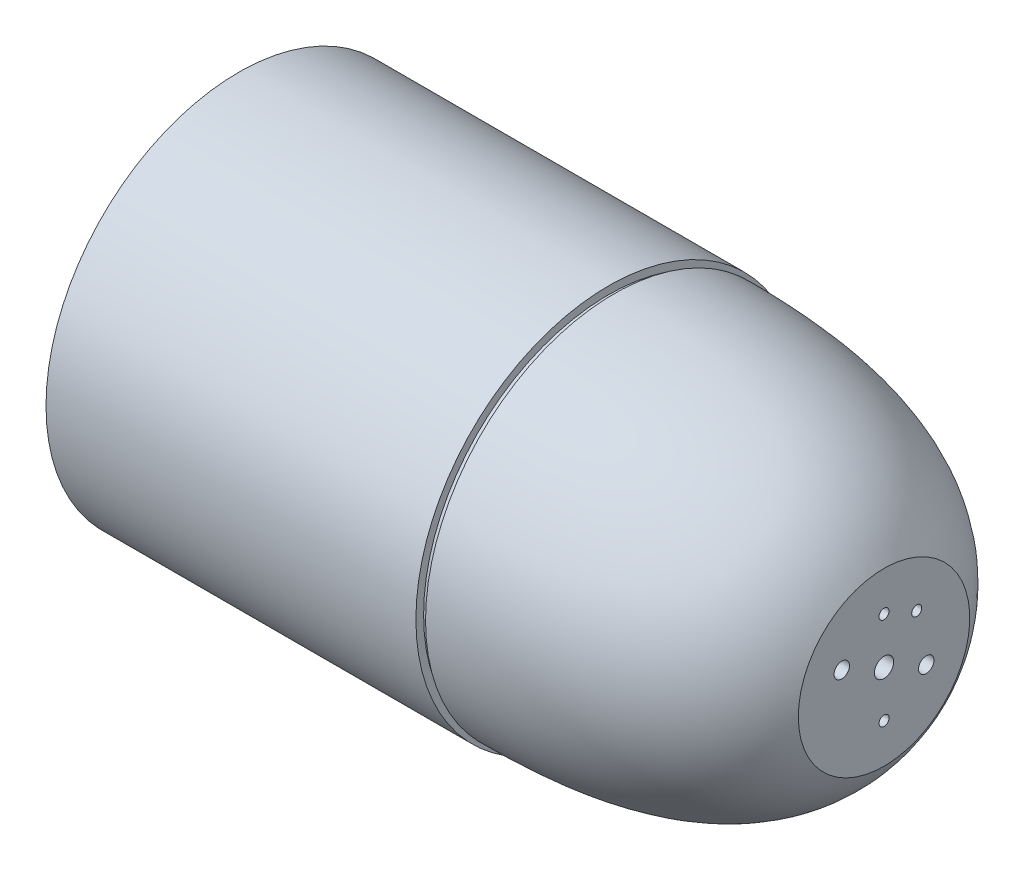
ISO-10303-21;
HEADER;
FILE_DESCRIPTION(('STEP AP214'),'2;1');
FILE_NAME('part.step','',(''),(''),'','','');
FILE_SCHEMA(('AUTOMOTIVE_DESIGN { 1 0 10303 214 1 1 1 1 }'));
ENDSEC;
DATA;
#1=APPLICATION_CONTEXT('core data for automotive mechanical design processes');
#2=APPLICATION_PROTOCOL_DEFINITION('international standard','automotive_design',2000,#1);
#3=PRODUCT_CONTEXT('',#1,'mechanical');
#4=PRODUCT('Part','Part','',(#3));
#5=PRODUCT_RELATED_PRODUCT_CATEGORY('part','',(#4));
#6=PRODUCT_DEFINITION_FORMATION('','',#4);
#7=PRODUCT_DEFINITION_CONTEXT('part definition',#1,'design');
#8=PRODUCT_DEFINITION('design','',#6,#7);
#9=PRODUCT_DEFINITION_SHAPE('','',#8);
#10=(LENGTH_UNIT() NAMED_UNIT(*) SI_UNIT(.MILLI.,.METRE.));
#11=(NAMED_UNIT(*) PLANE_ANGLE_UNIT() SI_UNIT($,.RADIAN.));
#12=(NAMED_UNIT(*) SI_UNIT($,.STERADIAN.) SOLID_ANGLE_UNIT());
#13=UNCERTAINTY_MEASURE_WITH_UNIT(LENGTH_MEASURE(1.E-05),#10,'distance_accuracy_value','');
#14=(GEOMETRIC_REPRESENTATION_CONTEXT(3) GLOBAL_UNCERTAINTY_ASSIGNED_CONTEXT((#13)) GLOBAL_UNIT_ASSIGNED_CONTEXT((#10,
#11,#12)) REPRESENTATION_CONTEXT('',''));
#15=CARTESIAN_POINT('',(0.,0.,0.));
#16=DIRECTION('',(0.,0.,1.));
#17=DIRECTION('',(1.,0.,0.));
#18=AXIS2_PLACEMENT_3D('',#15,#16,#17);
#19=CARTESIAN_POINT('',(192.,96.,0.));
#20=DIRECTION('',(-1.,0.,0.));
#21=DIRECTION('',(0.,0.,1.));
#22=AXIS2_PLACEMENT_3D('',#19,#20,#21);
#23=PLANE('',#22);
#24=CARTESIAN_POINT('',(192.,0.,0.));
#25=DIRECTION('',(-1.,0.,0.));
#26=DIRECTION('',(0.,0.,1.));
#27=AXIS2_PLACEMENT_3D('',#24,#25,#26);
#28=CIRCLE('',#27,100.);
#29=CARTESIAN_POINT('',(192.,0.,100.));
#30=VERTEX_POINT('',#29);
#31=EDGE_CURVE('E10',#30,#30,#28,.T.);
#32=ORIENTED_EDGE('',*,*,#31,.F.);
#33=EDGE_LOOP('',(#32));
#34=FACE_BOUND('',#33,.T.);
#35=CARTESIAN_POINT('',(192.,0.,0.));
#36=DIRECTION('',(-1.,0.,0.));
#37=DIRECTION('',(0.,0.,1.));
#38=AXIS2_PLACEMENT_3D('',#35,#36,#37);
#39=CIRCLE('',#38,96.);
#40=CARTESIAN_POINT('',(192.,0.,96.));
#41=VERTEX_POINT('',#40);
#42=EDGE_CURVE('E128',#41,#41,#39,.T.);
#43=ORIENTED_EDGE('',*,*,#42,.T.);
#44=EDGE_LOOP('',(#43));
#45=FACE_BOUND('',#44,.T.);
#46=ADVANCED_FACE('F30',(#34,#45),#23,.F.);
#47=CARTESIAN_POINT('',(-4.54259618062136,0.,0.));
#48=DIRECTION('',(-1.,0.,0.));
#49=DIRECTION('',(0.,0.,1.));
#50=AXIS2_PLACEMENT_3D('',#47,#48,#49);
#51=CYLINDRICAL_SURFACE('',#50,100.);
#52=CARTESIAN_POINT('',(0.,0.,0.));
#53=DIRECTION('',(-1.,0.,0.));
#54=DIRECTION('',(0.,0.,1.));
#55=AXIS2_PLACEMENT_3D('',#52,#53,#54);
#56=CIRCLE('',#55,100.);
#57=CARTESIAN_POINT('',(0.,0.,100.));
#58=VERTEX_POINT('',#57);
#59=EDGE_CURVE('E37',#58,#58,#56,.T.);
#60=ORIENTED_EDGE('',*,*,#59,.F.);
#61=EDGE_LOOP('',(#60));
#62=FACE_BOUND('',#61,.T.);
#63=ORIENTED_EDGE('',*,*,#31,.T.);
#64=EDGE_LOOP('',(#63));
#65=FACE_BOUND('',#64,.T.);
#66=ADVANCED_FACE('F200',(#62,#65),#51,.T.);
#67=CARTESIAN_POINT('',(0.,96.5,0.));
#68=DIRECTION('',(1.,0.,0.));
#69=DIRECTION('',(0.,0.,-1.));
#70=AXIS2_PLACEMENT_3D('',#67,#68,#69);
#71=PLANE('',#70);
#72=CARTESIAN_POINT('',(0.,0.,0.));
#73=DIRECTION('',(-1.,0.,0.));
#74=DIRECTION('',(0.,0.,1.));
#75=AXIS2_PLACEMENT_3D('',#72,#73,#74);
#76=CIRCLE('',#75,96.5);
#77=CARTESIAN_POINT('',(0.,0.,96.5));
#78=VERTEX_POINT('',#77);
#79=EDGE_CURVE('E42',#78,#78,#76,.T.);
#80=ORIENTED_EDGE('',*,*,#79,.F.);
#81=EDGE_LOOP('',(#80));
#82=FACE_BOUND('',#81,.T.);
#83=ORIENTED_EDGE('',*,*,#59,.T.);
#84=EDGE_LOOP('',(#83));
#85=FACE_BOUND('',#84,.T.);
#86=ADVANCED_FACE('F197',(#82,#85),#71,.F.);
#87=CARTESIAN_POINT('',(-4.54259618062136,0.,0.));
#88=DIRECTION('',(-1.,0.,0.));
#89=DIRECTION('',(0.,0.,1.));
#90=AXIS2_PLACEMENT_3D('',#87,#88,#89);
#91=CYLINDRICAL_SURFACE('',#90,96.5);
#92=CARTESIAN_POINT('',(1.99999999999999,0.,0.));
#93=DIRECTION('',(-1.,0.,0.));
#94=DIRECTION('',(0.,0.,1.));
#95=AXIS2_PLACEMENT_3D('',#92,#93,#94);
#96=CIRCLE('',#95,96.5);
#97=CARTESIAN_POINT('',(1.99999999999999,0.,96.5));
#98=VERTEX_POINT('',#97);
#99=EDGE_CURVE('E262',#98,#98,#96,.T.);
#100=ORIENTED_EDGE('',*,*,#99,.F.);
#101=EDGE_LOOP('',(#100));
#102=FACE_BOUND('',#101,.T.);
#103=ORIENTED_EDGE('',*,*,#79,.T.);
#104=EDGE_LOOP('',(#103));
#105=FACE_BOUND('',#104,.T.);
#106=ADVANCED_FACE('F193',(#102,#105),#91,.F.);
#107=CARTESIAN_POINT('',(2.,0.,0.));
#108=DIRECTION('',(-1.,0.,0.));
#109=DIRECTION('',(0.,0.,1.));
#110=AXIS2_PLACEMENT_3D('',#107,#108,#109);
#111=TOROIDAL_SURFACE('',#110,95.5,1.);
#112=CARTESIAN_POINT('',(3.,0.,0.));
#113=DIRECTION('',(-1.,0.,0.));
#114=DIRECTION('',(0.,0.,1.));
#115=AXIS2_PLACEMENT_3D('',#112,#113,#114);
#116=CIRCLE('',#115,95.5);
#117=CARTESIAN_POINT('',(3.,0.,95.5));
#118=VERTEX_POINT('',#117);
#119=EDGE_CURVE('E259',#118,#118,#116,.T.);
#120=ORIENTED_EDGE('',*,*,#119,.F.);
#121=EDGE_LOOP('',(#120));
#122=FACE_BOUND('',#121,.T.);
#123=ORIENTED_EDGE('',*,*,#99,.T.);
#124=EDGE_LOOP('',(#123));
#125=FACE_BOUND('',#124,.T.);
#126=ADVANCED_FACE('F189',(#122,#125),#111,.F.);
#127=CARTESIAN_POINT('',(3.,95.,0.));
#128=DIRECTION('',(1.,0.,0.));
#129=DIRECTION('',(0.,0.,-1.));
#130=AXIS2_PLACEMENT_3D('',#127,#128,#129);
#131=PLANE('',#130);
#132=CARTESIAN_POINT('',(3.,0.,0.));
#133=DIRECTION('',(-1.,0.,0.));
#134=DIRECTION('',(0.,0.,1.));
#135=AXIS2_PLACEMENT_3D('',#132,#133,#134);
#136=CIRCLE('',#135,95.);
#137=CARTESIAN_POINT('',(3.,0.,95.));
#138=VERTEX_POINT('',#137);
#139=EDGE_CURVE('E256',#138,#138,#136,.T.);
#140=ORIENTED_EDGE('',*,*,#139,.F.);
#141=EDGE_LOOP('',(#140));
#142=FACE_BOUND('',#141,.T.);
#143=ORIENTED_EDGE('',*,*,#119,.T.);
#144=EDGE_LOOP('',(#143));
#145=FACE_BOUND('',#144,.T.);
#146=ADVANCED_FACE('F185',(#142,#145),#131,.F.);
#147=CARTESIAN_POINT('',(-4.54259618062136,0.,0.));
#148=DIRECTION('',(-1.,0.,0.));
#149=DIRECTION('',(0.,0.,1.));
#150=AXIS2_PLACEMENT_3D('',#147,#148,#149);
#151=CYLINDRICAL_SURFACE('',#150,95.);
#152=CARTESIAN_POINT('',(30.5999999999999,0.,0.));
#153=DIRECTION('',(-1.,0.,0.));
#154=DIRECTION('',(0.,0.,1.));
#155=AXIS2_PLACEMENT_3D('',#152,#153,#154);
#156=CIRCLE('',#155,95.);
#157=CARTESIAN_POINT('',(30.5999999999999,0.,95.));
#158=VERTEX_POINT('',#157);
#159=EDGE_CURVE('E253',#158,#158,#156,.T.);
#160=ORIENTED_EDGE('',*,*,#159,.F.);
#161=EDGE_LOOP('',(#160));
#162=FACE_BOUND('',#161,.T.);
#163=ORIENTED_EDGE('',*,*,#139,.T.);
#164=EDGE_LOOP('',(#163));
#165=FACE_BOUND('',#164,.T.);
#166=ADVANCED_FACE('F181',(#162,#165),#151,.F.);
#167=CARTESIAN_POINT('',(30.5999999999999,0.,0.));
#168=DIRECTION('',(-1.,0.,0.));
#169=DIRECTION('',(0.,0.,1.));
#170=AXIS2_PLACEMENT_3D('',#167,#168,#169);
#171=CONICAL_SURFACE('',#170,95.,0.785398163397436);
#172=CARTESIAN_POINT('',(32.,0.,0.));
#173=DIRECTION('',(-1.,0.,0.));
#174=DIRECTION('',(0.,0.,1.));
#175=AXIS2_PLACEMENT_3D('',#172,#173,#174);
#176=CIRCLE('',#175,93.6);
#177=CARTESIAN_POINT('',(32.,0.,93.6));
#178=VERTEX_POINT('',#177);
#179=EDGE_CURVE('E250',#178,#178,#176,.T.);
#180=ORIENTED_EDGE('',*,*,#179,.F.);
#181=EDGE_LOOP('',(#180));
#182=FACE_BOUND('',#181,.T.);
#183=ORIENTED_EDGE('',*,*,#159,.T.);
#184=EDGE_LOOP('',(#183));
#185=FACE_BOUND('',#184,.T.);
#186=ADVANCED_FACE('F177',(#182,#185),#171,.F.);
#187=CARTESIAN_POINT('',(-4.54259618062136,0.,0.));
#188=DIRECTION('',(-1.,0.,0.));
#189=DIRECTION('',(0.,0.,1.));
#190=AXIS2_PLACEMENT_3D('',#187,#188,#189);
#191=CYLINDRICAL_SURFACE('',#190,93.6);
#192=CARTESIAN_POINT('',(37.,0.,0.));
#193=DIRECTION('',(-1.,0.,0.));
#194=DIRECTION('',(0.,0.,1.));
#195=AXIS2_PLACEMENT_3D('',#192,#193,#194);
#196=CIRCLE('',#195,93.6);
#197=CARTESIAN_POINT('',(37.,0.,93.6));
#198=VERTEX_POINT('',#197);
#199=EDGE_CURVE('E247',#198,#198,#196,.T.);
#200=ORIENTED_EDGE('',*,*,#199,.F.);
#201=EDGE_LOOP('',(#200));
#202=FACE_BOUND('',#201,.T.);
#203=ORIENTED_EDGE('',*,*,#179,.T.);
#204=EDGE_LOOP('',(#203));
#205=FACE_BOUND('',#204,.T.);
#206=ADVANCED_FACE('F173',(#202,#205),#191,.F.);
#207=CARTESIAN_POINT('',(37.,93.6,0.));
#208=DIRECTION('',(1.,0.,0.));
#209=DIRECTION('',(0.,0.,-1.));
#210=AXIS2_PLACEMENT_3D('',#207,#208,#209);
#211=PLANE('',#210);
#212=CARTESIAN_POINT('',(37.,-62.9325035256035,-62.932503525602));
#213=DIRECTION('',(-1.,0.,0.));
#214=DIRECTION('',(0.,-0.707106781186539,0.707106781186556));
#215=AXIS2_PLACEMENT_3D('',#212,#213,#214);
#216=CIRCLE('',#215,2.25);
#217=CARTESIAN_POINT('',(37.,-64.5234937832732,-61.3415132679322));
#218=VERTEX_POINT('',#217);
#219=EDGE_CURVE('E82',#218,#218,#216,.T.);
#220=ORIENTED_EDGE('',*,*,#219,.F.);
#221=EDGE_LOOP('',(#220));
#222=FACE_BOUND('',#221,.T.);
#223=CARTESIAN_POINT('',(37.,-9.32225517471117E-13,-89.));
#224=DIRECTION('',(-1.,0.,0.));
#225=DIRECTION('',(0.,-1.,0.));
#226=AXIS2_PLACEMENT_3D('',#223,#224,#225);
#227=CIRCLE('',#226,2.25);
#228=CARTESIAN_POINT('',(37.,-2.25000000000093,-89.));
#229=VERTEX_POINT('',#228);
#230=EDGE_CURVE('E72',#229,#229,#227,.T.);
#231=ORIENTED_EDGE('',*,*,#230,.F.);
#232=EDGE_LOOP('',(#231));
#233=FACE_BOUND('',#232,.T.);
#234=CARTESIAN_POINT('',(37.,62.9325035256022,-62.9325035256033));
#235=DIRECTION('',(-1.,0.,0.));
#236=DIRECTION('',(0.,-0.707106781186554,-0.707106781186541));
#237=AXIS2_PLACEMENT_3D('',#234,#235,#236);
#238=CIRCLE('',#237,2.25);
#239=CARTESIAN_POINT('',(37.,61.3415132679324,-64.523493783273));
#240=VERTEX_POINT('',#239);
#241=EDGE_CURVE('E69',#240,#240,#238,.T.);
#242=ORIENTED_EDGE('',*,*,#241,.F.);
#243=EDGE_LOOP('',(#242));
#244=FACE_BOUND('',#243,.T.);
#245=CARTESIAN_POINT('',(37.,89.,0.));
#246=DIRECTION('',(-1.,0.,0.));
#247=DIRECTION('',(0.,0.,-1.));
#248=AXIS2_PLACEMENT_3D('',#245,#246,#247);
#249=CIRCLE('',#248,2.25);
#250=CARTESIAN_POINT('',(37.,89.,-2.25));
#251=VERTEX_POINT('',#250);
#252=EDGE_CURVE('E66',#251,#251,#249,.T.);
#253=ORIENTED_EDGE('',*,*,#252,.F.);
#254=EDGE_LOOP('',(#253));
#255=FACE_BOUND('',#254,.T.);
#256=CARTESIAN_POINT('',(37.,62.9325035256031,62.9325035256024));
#257=DIRECTION('',(-1.,0.,0.));
#258=DIRECTION('',(0.,0.707106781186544,-0.707106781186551));
#259=AXIS2_PLACEMENT_3D('',#256,#257,#258);
#260=CIRCLE('',#259,2.25);
#261=CARTESIAN_POINT('',(37.,64.5234937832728,61.3415132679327));
#262=VERTEX_POINT('',#261);
#263=EDGE_CURVE('E62',#262,#262,#260,.T.);
#264=ORIENTED_EDGE('',*,*,#263,.F.);
#265=EDGE_LOOP('',(#264));
#266=FACE_BOUND('',#265,.T.);
#267=CARTESIAN_POINT('',(37.,3.10741839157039E-13,89.));
#268=DIRECTION('',(-1.,0.,0.));
#269=DIRECTION('',(0.,1.,0.));
#270=AXIS2_PLACEMENT_3D('',#267,#268,#269);
#271=CIRCLE('',#270,2.25);
#272=CARTESIAN_POINT('',(37.,2.25000000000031,89.));
#273=VERTEX_POINT('',#272);
#274=EDGE_CURVE('E58',#273,#273,#271,.T.);
#275=ORIENTED_EDGE('',*,*,#274,.F.);
#276=EDGE_LOOP('',(#275));
#277=FACE_BOUND('',#276,.T.);
#278=CARTESIAN_POINT('',(37.,-62.9325035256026,62.9325035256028));
#279=DIRECTION('',(-1.,0.,0.));
#280=DIRECTION('',(0.,0.707106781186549,0.707106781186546));
#281=AXIS2_PLACEMENT_3D('',#278,#279,#280);
#282=CIRCLE('',#281,2.25);
#283=CARTESIAN_POINT('',(37.,-61.3415132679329,64.5234937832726));
#284=VERTEX_POINT('',#283);
#285=EDGE_CURVE('E54',#284,#284,#282,.T.);
#286=ORIENTED_EDGE('',*,*,#285,.F.);
#287=EDGE_LOOP('',(#286));
#288=FACE_BOUND('',#287,.T.);
#289=CARTESIAN_POINT('',(37.,-89.,0.));
#290=DIRECTION('',(-1.,0.,0.));
#291=DIRECTION('',(0.,0.,1.));
#292=AXIS2_PLACEMENT_3D('',#289,#290,#291);
#293=CIRCLE('',#292,2.25);
#294=CARTESIAN_POINT('',(37.,-89.,2.25));
#295=VERTEX_POINT('',#294);
#296=EDGE_CURVE('E50',#295,#295,#293,.T.);
#297=ORIENTED_EDGE('',*,*,#296,.F.);
#298=EDGE_LOOP('',(#297));
#299=FACE_BOUND('',#298,.T.);
#300=CARTESIAN_POINT('',(37.,0.,0.));
#301=DIRECTION('',(-1.,0.,0.));
#302=DIRECTION('',(0.,0.,1.));
#303=AXIS2_PLACEMENT_3D('',#300,#301,#302);
#304=CIRCLE('',#303,85.5);
#305=CARTESIAN_POINT('',(37.,0.,85.5));
#306=VERTEX_POINT('',#305);
#307=EDGE_CURVE('E244',#306,#306,#304,.T.);
#308=ORIENTED_EDGE('',*,*,#307,.F.);
#309=EDGE_LOOP('',(#308));
#310=FACE_BOUND('',#309,.T.);
#311=ORIENTED_EDGE('',*,*,#199,.T.);
#312=EDGE_LOOP('',(#311));
#313=FACE_BOUND('',#312,.T.);
#314=ADVANCED_FACE('F169',(#222,#233,#244,#255,#266,#277,#288,#299,#310,#313),#211,.F.);
#315=CARTESIAN_POINT('',(-4.54259618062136,0.,0.));
#316=DIRECTION('',(-1.,0.,0.));
#317=DIRECTION('',(0.,0.,1.));
#318=AXIS2_PLACEMENT_3D('',#315,#316,#317);
#319=CYLINDRICAL_SURFACE('',#318,85.5);
#320=CARTESIAN_POINT('',(45.,0.,0.));
#321=DIRECTION('',(-1.,0.,0.));
#322=DIRECTION('',(0.,0.,1.));
#323=AXIS2_PLACEMENT_3D('',#320,#321,#322);
#324=CIRCLE('',#323,85.5);
#325=CARTESIAN_POINT('',(45.,0.,85.5));
#326=VERTEX_POINT('',#325);
#327=EDGE_CURVE('E241',#326,#326,#324,.T.);
#328=ORIENTED_EDGE('',*,*,#327,.F.);
#329=EDGE_LOOP('',(#328));
#330=FACE_BOUND('',#329,.T.);
#331=ORIENTED_EDGE('',*,*,#307,.T.);
#332=EDGE_LOOP('',(#331));
#333=FACE_BOUND('',#332,.T.);
#334=ADVANCED_FACE('F165',(#330,#333),#319,.F.);
#335=CARTESIAN_POINT('',(45.,93.6,0.));
#336=DIRECTION('',(-1.,0.,0.));
#337=DIRECTION('',(0.,0.,1.));
#338=AXIS2_PLACEMENT_3D('',#335,#336,#337);
#339=PLANE('',#338);
#340=CARTESIAN_POINT('',(45.,-62.9325035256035,-62.932503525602));
#341=DIRECTION('',(-1.,0.,0.));
#342=DIRECTION('',(0.,0.,1.));
#343=AXIS2_PLACEMENT_3D('',#340,#341,#342);
#344=CIRCLE('',#343,2.25);
#345=CARTESIAN_POINT('',(45.,-62.9325035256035,-60.682503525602));
#346=VERTEX_POINT('',#345);
#347=EDGE_CURVE('E33',#346,#346,#344,.T.);
#348=ORIENTED_EDGE('',*,*,#347,.T.);
#349=EDGE_LOOP('',(#348));
#350=FACE_BOUND('',#349,.T.);
#351=CARTESIAN_POINT('',(45.,-9.32225517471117E-13,-89.));
#352=DIRECTION('',(-1.,0.,0.));
#353=DIRECTION('',(0.,0.,1.));
#354=AXIS2_PLACEMENT_3D('',#351,#352,#353);
#355=CIRCLE('',#354,2.25);
#356=CARTESIAN_POINT('',(45.,-9.32225517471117E-13,-86.75));
#357=VERTEX_POINT('',#356);
#358=EDGE_CURVE('E70',#357,#357,#355,.T.);
#359=ORIENTED_EDGE('',*,*,#358,.T.);
#360=EDGE_LOOP('',(#359));
#361=FACE_BOUND('',#360,.T.);
#362=CARTESIAN_POINT('',(45.,62.9325035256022,-62.9325035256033));
#363=DIRECTION('',(-1.,0.,0.));
#364=DIRECTION('',(0.,0.,1.));
#365=AXIS2_PLACEMENT_3D('',#362,#363,#364);
#366=CIRCLE('',#365,2.25);
#367=CARTESIAN_POINT('',(45.,62.9325035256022,-60.6825035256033));
#368=VERTEX_POINT('',#367);
#369=EDGE_CURVE('E67',#368,#368,#366,.T.);
#370=ORIENTED_EDGE('',*,*,#369,.T.);
#371=EDGE_LOOP('',(#370));
#372=FACE_BOUND('',#371,.T.);
#373=CARTESIAN_POINT('',(45.,89.,0.));
#374=DIRECTION('',(-1.,0.,0.));
#375=DIRECTION('',(0.,0.,1.));
#376=AXIS2_PLACEMENT_3D('',#373,#374,#375);
#377=CIRCLE('',#376,2.25);
#378=CARTESIAN_POINT('',(45.,89.,2.25));
#379=VERTEX_POINT('',#378);
#380=EDGE_CURVE('E63',#379,#379,#377,.T.);
#381=ORIENTED_EDGE('',*,*,#380,.T.);
#382=EDGE_LOOP('',(#381));
#383=FACE_BOUND('',#382,.T.);
#384=CARTESIAN_POINT('',(45.,62.9325035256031,62.9325035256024));
#385=DIRECTION('',(-1.,0.,0.));
#386=DIRECTION('',(0.,0.,1.));
#387=AXIS2_PLACEMENT_3D('',#384,#385,#386);
#388=CIRCLE('',#387,2.25);
#389=CARTESIAN_POINT('',(45.,62.9325035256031,65.1825035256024));
#390=VERTEX_POINT('',#389);
#391=EDGE_CURVE('E59',#390,#390,#388,.T.);
#392=ORIENTED_EDGE('',*,*,#391,.T.);
#393=EDGE_LOOP('',(#392));
#394=FACE_BOUND('',#393,.T.);
#395=CARTESIAN_POINT('',(45.,3.10741839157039E-13,89.));
#396=DIRECTION('',(-1.,0.,0.));
#397=DIRECTION('',(0.,0.,1.));
#398=AXIS2_PLACEMENT_3D('',#395,#396,#397);
#399=CIRCLE('',#398,2.25);
#400=CARTESIAN_POINT('',(45.,3.10741839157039E-13,91.25));
#401=VERTEX_POINT('',#400);
#402=EDGE_CURVE('E55',#401,#401,#399,.T.);
#403=ORIENTED_EDGE('',*,*,#402,.T.);
#404=EDGE_LOOP('',(#403));
#405=FACE_BOUND('',#404,.T.);
#406=CARTESIAN_POINT('',(45.,-62.9325035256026,62.9325035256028));
#407=DIRECTION('',(-1.,0.,0.));
#408=DIRECTION('',(0.,0.,1.));
#409=AXIS2_PLACEMENT_3D('',#406,#407,#408);
#410=CIRCLE('',#409,2.25);
#411=CARTESIAN_POINT('',(45.,-62.9325035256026,65.1825035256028));
#412=VERTEX_POINT('',#411);
#413=EDGE_CURVE('E51',#412,#412,#410,.T.);
#414=ORIENTED_EDGE('',*,*,#413,.T.);
#415=EDGE_LOOP('',(#414));
#416=FACE_BOUND('',#415,.T.);
#417=CARTESIAN_POINT('',(45.,-89.,0.));
#418=DIRECTION('',(-1.,0.,0.));
#419=DIRECTION('',(0.,0.,1.));
#420=AXIS2_PLACEMENT_3D('',#417,#418,#419);
#421=CIRCLE('',#420,2.25);
#422=CARTESIAN_POINT('',(45.,-89.,2.25));
#423=VERTEX_POINT('',#422);
#424=EDGE_CURVE('E46',#423,#423,#421,.T.);
#425=ORIENTED_EDGE('',*,*,#424,.T.);
#426=EDGE_LOOP('',(#425));
#427=FACE_BOUND('',#426,.T.);
#428=CARTESIAN_POINT('',(45.,0.,0.));
#429=DIRECTION('',(-1.,0.,0.));
#430=DIRECTION('',(0.,0.,1.));
#431=AXIS2_PLACEMENT_3D('',#428,#429,#430);
#432=CIRCLE('',#431,93.6);
#433=CARTESIAN_POINT('',(45.,0.,93.6));
#434=VERTEX_POINT('',#433);
#435=EDGE_CURVE('E238',#434,#434,#432,.T.);
#436=ORIENTED_EDGE('',*,*,#435,.F.);
#437=EDGE_LOOP('',(#436));
#438=FACE_BOUND('',#437,.T.);
#439=ORIENTED_EDGE('',*,*,#327,.T.);
#440=EDGE_LOOP('',(#439));
#441=FACE_BOUND('',#440,.T.);
#442=ADVANCED_FACE('F161',(#350,#361,#372,#383,#394,#405,#416,#427,#438,#441),#339,.F.);
#443=CARTESIAN_POINT('',(-4.54259618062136,0.,0.));
#444=DIRECTION('',(-1.,0.,0.));
#445=DIRECTION('',(0.,0.,1.));
#446=AXIS2_PLACEMENT_3D('',#443,#444,#445);
#447=CYLINDRICAL_SURFACE('',#446,93.5999999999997);
#448=CARTESIAN_POINT('',(180.,0.,0.));
#449=DIRECTION('',(-1.,0.,0.));
#450=DIRECTION('',(0.,0.,1.));
#451=AXIS2_PLACEMENT_3D('',#448,#449,#450);
#452=CIRCLE('',#451,93.5999999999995);
#453=CARTESIAN_POINT('',(180.,0.,93.5999999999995));
#454=VERTEX_POINT('',#453);
#455=EDGE_CURVE('E235',#454,#454,#452,.T.);
#456=ORIENTED_EDGE('',*,*,#455,.F.);
#457=EDGE_LOOP('',(#456));
#458=FACE_BOUND('',#457,.T.);
#459=ORIENTED_EDGE('',*,*,#435,.T.);
#460=EDGE_LOOP('',(#459));
#461=FACE_BOUND('',#460,.T.);
#462=ADVANCED_FACE('F157',(#458,#461),#447,.F.);
#463=CARTESIAN_POINT('',(180.,0.,0.));
#464=DIRECTION('',(-1.,0.,0.));
#465=DIRECTION('',(0.,0.,1.));
#466=AXIS2_PLACEMENT_3D('',#463,#464,#465);
#467=CONICAL_SURFACE('',#466,93.5999999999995,0.785398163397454);
#468=CARTESIAN_POINT('',(184.599999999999,0.,0.));
#469=DIRECTION('',(-1.,0.,0.));
#470=DIRECTION('',(0.,0.,1.));
#471=AXIS2_PLACEMENT_3D('',#468,#469,#470);
#472=CIRCLE('',#471,89.);
#473=CARTESIAN_POINT('',(184.599999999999,0.,89.));
#474=VERTEX_POINT('',#473);
#475=EDGE_CURVE('E232',#474,#474,#472,.T.);
#476=ORIENTED_EDGE('',*,*,#475,.F.);
#477=EDGE_LOOP('',(#476));
#478=FACE_BOUND('',#477,.T.);
#479=ORIENTED_EDGE('',*,*,#455,.T.);
#480=EDGE_LOOP('',(#479));
#481=FACE_BOUND('',#480,.T.);
#482=ADVANCED_FACE('F153',(#478,#481),#467,.F.);
#483=CARTESIAN_POINT('',(-4.54259618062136,0.,0.));
#484=DIRECTION('',(-1.,0.,0.));
#485=DIRECTION('',(0.,0.,1.));
#486=AXIS2_PLACEMENT_3D('',#483,#484,#485);
#487=CYLINDRICAL_SURFACE('',#486,89.);
#488=CARTESIAN_POINT('',(192.,0.,0.));
#489=DIRECTION('',(-1.,0.,0.));
#490=DIRECTION('',(0.,0.,1.));
#491=AXIS2_PLACEMENT_3D('',#488,#489,#490);
#492=CIRCLE('',#491,89.);
#493=CARTESIAN_POINT('',(192.,0.,89.));
#494=VERTEX_POINT('',#493);
#495=EDGE_CURVE('E229',#494,#494,#492,.T.);
#496=ORIENTED_EDGE('',*,*,#495,.F.);
#497=EDGE_LOOP('',(#496));
#498=FACE_BOUND('',#497,.T.);
#499=ORIENTED_EDGE('',*,*,#475,.T.);
#500=EDGE_LOOP('',(#499));
#501=FACE_BOUND('',#500,.T.);
#502=ADVANCED_FACE('F148',(#498,#501),#487,.F.);
#503=CARTESIAN_POINT('',(192.,89.,0.));
#504=CARTESIAN_POINT('',(231.987788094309,89.,0.));
#505=CARTESIAN_POINT('',(299.104578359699,86.7944297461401,0.));
#506=CARTESIAN_POINT('',(326.,42.,0.));
#507=B_SPLINE_CURVE_WITH_KNOTS('',3,(#503,#504,#505,#506),.UNSPECIFIED.,.F.,.F.,(4,4),(0.,1.),.UNSPECIFIED.);
#508=CARTESIAN_POINT('',(-4.54259618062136,0.,0.));
#509=DIRECTION('',(-1.,0.,0.));
#510=AXIS1_PLACEMENT('',#508,#509);
#511=SURFACE_OF_REVOLUTION('',#507,#510);
#512=CARTESIAN_POINT('',(326.,0.,0.));
#513=DIRECTION('',(-1.,0.,0.));
#514=DIRECTION('',(0.,0.,1.));
#515=AXIS2_PLACEMENT_3D('',#512,#513,#514);
#516=CIRCLE('',#515,42.);
#517=CARTESIAN_POINT('',(326.,0.,42.));
#518=VERTEX_POINT('',#517);
#519=EDGE_CURVE('E226',#518,#518,#516,.T.);
#520=ORIENTED_EDGE('',*,*,#519,.F.);
#521=EDGE_LOOP('',(#520));
#522=FACE_BOUND('',#521,.T.);
#523=ORIENTED_EDGE('',*,*,#495,.T.);
#524=EDGE_LOOP('',(#523));
#525=FACE_BOUND('',#524,.T.);
#526=ADVANCED_FACE('F143',(#522,#525),#511,.T.);
#527=CARTESIAN_POINT('',(326.,0.,0.));
#528=DIRECTION('',(1.,0.,0.));
#529=DIRECTION('',(0.,0.,-1.));
#530=AXIS2_PLACEMENT_3D('',#527,#528,#529);
#531=PLANE('',#530);
#532=CARTESIAN_POINT('',(326.,-24.,0.));
#533=DIRECTION('',(-1.,0.,0.));
#534=DIRECTION('',(0.,0.,1.));
#535=AXIS2_PLACEMENT_3D('',#532,#533,#534);
#536=CIRCLE('',#535,2.6);
#537=CARTESIAN_POINT('',(326.,-24.,2.6));
#538=VERTEX_POINT('',#537);
#539=EDGE_CURVE('E49',#538,#538,#536,.T.);
#540=ORIENTED_EDGE('',*,*,#539,.F.);
#541=EDGE_LOOP('',(#540));
#542=FACE_BOUND('',#541,.T.);
#543=CARTESIAN_POINT('',(326.,16.970562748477,-16.9705627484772));
#544=DIRECTION('',(-1.,0.,0.));
#545=DIRECTION('',(0.,0.,1.));
#546=AXIS2_PLACEMENT_3D('',#543,#544,#545);
#547=CIRCLE('',#546,2.6);
#548=CARTESIAN_POINT('',(326.,16.970562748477,-14.3705627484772));
#549=VERTEX_POINT('',#548);
#550=EDGE_CURVE('E98',#549,#549,#547,.T.);
#551=ORIENTED_EDGE('',*,*,#550,.F.);
#552=EDGE_LOOP('',(#551));
#553=FACE_BOUND('',#552,.T.);
#554=CARTESIAN_POINT('',(326.,24.,0.));
#555=DIRECTION('',(-1.,0.,0.));
#556=DIRECTION('',(0.,0.,1.));
#557=AXIS2_PLACEMENT_3D('',#554,#555,#556);
#558=CIRCLE('',#557,2.6);
#559=CARTESIAN_POINT('',(326.,24.,2.6));
#560=VERTEX_POINT('',#559);
#561=EDGE_CURVE('E104',#560,#560,#558,.T.);
#562=ORIENTED_EDGE('',*,*,#561,.F.);
#563=EDGE_LOOP('',(#562));
#564=FACE_BOUND('',#563,.T.);
#565=CARTESIAN_POINT('',(326.,-9.76167943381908,-21.9250909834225));
#566=DIRECTION('',(-1.,0.,0.));
#567=DIRECTION('',(0.,0.,1.));
#568=AXIS2_PLACEMENT_3D('',#565,#566,#567);
#569=CIRCLE('',#568,4.);
#570=CARTESIAN_POINT('',(326.,-9.76167943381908,-17.9250909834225));
#571=VERTEX_POINT('',#570);
#572=EDGE_CURVE('E110',#571,#571,#569,.T.);
#573=ORIENTED_EDGE('',*,*,#572,.F.);
#574=EDGE_LOOP('',(#573));
#575=FACE_BOUND('',#574,.T.);
#576=CARTESIAN_POINT('',(326.,9.76167943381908,21.9250909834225));
#577=DIRECTION('',(-1.,0.,0.));
#578=DIRECTION('',(0.,0.,1.));
#579=AXIS2_PLACEMENT_3D('',#576,#577,#578);
#580=CIRCLE('',#579,4.);
#581=CARTESIAN_POINT('',(326.,9.76167943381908,25.9250909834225));
#582=VERTEX_POINT('',#581);
#583=EDGE_CURVE('E116',#582,#582,#580,.T.);
#584=ORIENTED_EDGE('',*,*,#583,.F.);
#585=EDGE_LOOP('',(#584));
#586=FACE_BOUND('',#585,.T.);
#587=CARTESIAN_POINT('',(326.,0.,0.));
#588=DIRECTION('',(-1.,0.,0.));
#589=DIRECTION('',(0.,0.,1.));
#590=AXIS2_PLACEMENT_3D('',#587,#588,#589);
#591=CIRCLE('',#590,5.);
#592=CARTESIAN_POINT('',(326.,0.,5.));
#593=VERTEX_POINT('',#592);
#594=EDGE_CURVE('E122',#593,#593,#591,.T.);
#595=ORIENTED_EDGE('',*,*,#594,.F.);
#596=EDGE_LOOP('',(#595));
#597=FACE_BOUND('',#596,.T.);
#598=ORIENTED_EDGE('',*,*,#519,.T.);
#599=EDGE_LOOP('',(#598));
#600=FACE_BOUND('',#599,.T.);
#601=ADVANCED_FACE('F147',(#542,#553,#564,#575,#586,#597,#600),#531,.F.);
#602=CARTESIAN_POINT('',(335.,0.,0.));
#603=DIRECTION('',(-1.,0.,0.));
#604=DIRECTION('',(0.,0.,1.));
#605=AXIS2_PLACEMENT_3D('',#602,#603,#604);
#606=PLANE('',#605);
#607=CARTESIAN_POINT('',(335.,-24.,0.));
#608=DIRECTION('',(-1.,0.,0.));
#609=DIRECTION('',(0.,0.,1.));
#610=AXIS2_PLACEMENT_3D('',#607,#608,#609);
#611=CIRCLE('',#610,2.6);
#612=CARTESIAN_POINT('',(335.,-24.,2.6));
#613=VERTEX_POINT('',#612);
#614=EDGE_CURVE('E95',#613,#613,#611,.T.);
#615=ORIENTED_EDGE('',*,*,#614,.T.);
#616=EDGE_LOOP('',(#615));
#617=FACE_BOUND('',#616,.T.);
#618=CARTESIAN_POINT('',(335.,16.970562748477,-16.9705627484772));
#619=DIRECTION('',(-1.,0.,0.));
#620=DIRECTION('',(0.,0.,1.));
#621=AXIS2_PLACEMENT_3D('',#618,#619,#620);
#622=CIRCLE('',#621,2.6);
#623=CARTESIAN_POINT('',(335.,16.970562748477,-14.3705627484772));
#624=VERTEX_POINT('',#623);
#625=EDGE_CURVE('E101',#624,#624,#622,.T.);
#626=ORIENTED_EDGE('',*,*,#625,.T.);
#627=EDGE_LOOP('',(#626));
#628=FACE_BOUND('',#627,.T.);
#629=CARTESIAN_POINT('',(335.,24.,0.));
#630=DIRECTION('',(-1.,0.,0.));
#631=DIRECTION('',(0.,0.,1.));
#632=AXIS2_PLACEMENT_3D('',#629,#630,#631);
#633=CIRCLE('',#632,2.6);
#634=CARTESIAN_POINT('',(335.,24.,2.6));
#635=VERTEX_POINT('',#634);
#636=EDGE_CURVE('E107',#635,#635,#633,.T.);
#637=ORIENTED_EDGE('',*,*,#636,.T.);
#638=EDGE_LOOP('',(#637));
#639=FACE_BOUND('',#638,.T.);
#640=CARTESIAN_POINT('',(335.,-9.76167943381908,-21.9250909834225));
#641=DIRECTION('',(-1.,0.,0.));
#642=DIRECTION('',(0.,0.,1.));
#643=AXIS2_PLACEMENT_3D('',#640,#641,#642);
#644=CIRCLE('',#643,4.);
#645=CARTESIAN_POINT('',(335.,-9.76167943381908,-17.9250909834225));
#646=VERTEX_POINT('',#645);
#647=EDGE_CURVE('E113',#646,#646,#644,.T.);
#648=ORIENTED_EDGE('',*,*,#647,.T.);
#649=EDGE_LOOP('',(#648));
#650=FACE_BOUND('',#649,.T.);
#651=CARTESIAN_POINT('',(335.,9.76167943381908,21.9250909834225));
#652=DIRECTION('',(-1.,0.,0.));
#653=DIRECTION('',(0.,0.,1.));
#654=AXIS2_PLACEMENT_3D('',#651,#652,#653);
#655=CIRCLE('',#654,4.);
#656=CARTESIAN_POINT('',(335.,9.76167943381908,25.9250909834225));
#657=VERTEX_POINT('',#656);
#658=EDGE_CURVE('E119',#657,#657,#655,.T.);
#659=ORIENTED_EDGE('',*,*,#658,.T.);
#660=EDGE_LOOP('',(#659));
#661=FACE_BOUND('',#660,.T.);
#662=CARTESIAN_POINT('',(335.,0.,0.));
#663=DIRECTION('',(-1.,0.,0.));
#664=DIRECTION('',(0.,0.,1.));
#665=AXIS2_PLACEMENT_3D('',#662,#663,#664);
#666=CIRCLE('',#665,5.);
#667=CARTESIAN_POINT('',(335.,0.,5.));
#668=VERTEX_POINT('',#667);
#669=EDGE_CURVE('E125',#668,#668,#666,.T.);
#670=ORIENTED_EDGE('',*,*,#669,.T.);
#671=EDGE_LOOP('',(#670));
#672=FACE_BOUND('',#671,.T.);
#673=CARTESIAN_POINT('',(335.,0.,0.));
#674=DIRECTION('',(-1.,0.,0.));
#675=DIRECTION('',(0.,0.,1.));
#676=AXIS2_PLACEMENT_3D('',#673,#674,#675);
#677=CIRCLE('',#676,44.4943478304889);
#678=CARTESIAN_POINT('',(335.,0.,44.4943478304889));
#679=VERTEX_POINT('',#678);
#680=EDGE_CURVE('E223',#679,#679,#677,.T.);
#681=ORIENTED_EDGE('',*,*,#680,.F.);
#682=EDGE_LOOP('',(#681));
#683=FACE_BOUND('',#682,.T.);
#684=ADVANCED_FACE('F296',(#617,#628,#639,#650,#661,#672,#683),#606,.F.);
#685=CARTESIAN_POINT('',(335.,44.4943478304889,0.));
#686=CARTESIAN_POINT('',(334.786535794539,44.849873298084,0.));
#687=CARTESIAN_POINT('',(334.468175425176,45.3802516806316,0.));
#688=CARTESIAN_POINT('',(334.036351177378,46.0990621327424,0.));
#689=CARTESIAN_POINT('',(333.730842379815,46.6090717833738,0.));
#690=CARTESIAN_POINT('',(333.355567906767,47.2296545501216,0.));
#691=CARTESIAN_POINT('',(332.87145491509,48.0124943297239,0.));
#692=CARTESIAN_POINT('',(331.999077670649,49.3850699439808,0.));
#693=CARTESIAN_POINT('',(330.716223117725,51.2924181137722,0.));
#694=CARTESIAN_POINT('',(328.57436275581,54.2556982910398,0.));
#695=CARTESIAN_POINT('',(325.742347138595,57.7828856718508,0.));
#696=CARTESIAN_POINT('',(320.904965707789,63.0587227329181,0.));
#697=CARTESIAN_POINT('',(314.336430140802,68.9746607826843,0.));
#698=CARTESIAN_POINT('',(302.919932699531,77.0764965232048,0.));
#699=CARTESIAN_POINT('',(287.309278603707,84.849996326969,0.));
#700=CARTESIAN_POINT('',(267.376963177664,91.1247876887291,0.));
#701=CARTESIAN_POINT('',(250.434914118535,94.3620796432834,0.));
#702=CARTESIAN_POINT('',(237.071471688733,96.0519252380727,0.));
#703=CARTESIAN_POINT('',(227.242200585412,96.9383340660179,0.));
#704=CARTESIAN_POINT('',(217.705838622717,97.5115648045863,0.));
#705=CARTESIAN_POINT('',(210.087191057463,97.7833970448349,0.));
#706=CARTESIAN_POINT('',(204.241682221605,97.9099234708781,0.));
#707=CARTESIAN_POINT('',(199.994363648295,97.9674090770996,0.));
#708=CARTESIAN_POINT('',(196.584348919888,97.9908339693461,0.));
#709=CARTESIAN_POINT('',(193.931646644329,97.9988794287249,0.));
#710=CARTESIAN_POINT('',(192.647390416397,98.,0.));
#711=CARTESIAN_POINT('',(192.,98.,0.));
#712=B_SPLINE_CURVE_WITH_KNOTS('',3,(#685,#686,#687,#688,#689,#690,#691,#692,#693,#694,#695,
#696,#697,#698,#699,#700,#701,#702,#703,#704,#705,#706,#707,#708,#709,#710,#711),.UNSPECIFIED.,
.F.,.F.,(4,1,1,1,1,1,1,1,1,1,1,1,1,1,1,1,1,1,1,1,1,1,1,1,4),(0.,0.00793682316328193,
0.0119052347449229,0.0158736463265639,0.0198420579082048,0.0238104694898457,0.0317472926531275,
0.0476209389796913,0.0634945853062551,0.0952418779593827,0.12698917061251,0.190483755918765,
0.25397834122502,0.38096751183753,0.507956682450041,0.634945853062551,0.698440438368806,
0.761935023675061,0.825429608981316,0.888924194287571,0.920671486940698,0.952418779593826,
0.984166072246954,1.00003971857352,1.01591336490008),.UNSPECIFIED.);
#713=CARTESIAN_POINT('',(-4.54259618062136,0.,0.));
#714=DIRECTION('',(-1.,0.,0.));
#715=AXIS1_PLACEMENT('',#713,#714);
#716=SURFACE_OF_REVOLUTION('',#712,#715);
#717=CARTESIAN_POINT('',(194.999999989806,0.,0.));
#718=DIRECTION('',(-1.,0.,0.));
#719=DIRECTION('',(0.,0.,1.));
#720=AXIS2_PLACEMENT_3D('',#717,#718,#719);
#721=CIRCLE('',#720,97.995435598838);
#722=CARTESIAN_POINT('',(194.999999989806,0.,97.995435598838));
#723=VERTEX_POINT('',#722);
#724=EDGE_CURVE('E218',#723,#723,#721,.T.);
#725=ORIENTED_EDGE('',*,*,#724,.F.);
#726=EDGE_LOOP('',(#725));
#727=FACE_BOUND('',#726,.T.);
#728=ORIENTED_EDGE('',*,*,#680,.T.);
#729=EDGE_LOOP('',(#728));
#730=FACE_BOUND('',#729,.T.);
#731=ADVANCED_FACE('F301',(#727,#730),#716,.T.);
#732=CARTESIAN_POINT('',(194.999999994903,96.,0.));
#733=DIRECTION('',(1.,0.,0.));
#734=DIRECTION('',(0.,0.,-1.));
#735=AXIS2_PLACEMENT_3D('',#732,#733,#734);
#736=PLANE('',#735);
#737=CARTESIAN_POINT('',(195.,0.,0.));
#738=DIRECTION('',(-1.,0.,0.));
#739=DIRECTION('',(0.,0.,1.));
#740=AXIS2_PLACEMENT_3D('',#737,#738,#739);
#741=CIRCLE('',#740,96.);
#742=CARTESIAN_POINT('',(195.,0.,96.));
#743=VERTEX_POINT('',#742);
#744=EDGE_CURVE('E216',#743,#743,#741,.T.);
#745=ORIENTED_EDGE('',*,*,#744,.F.);
#746=EDGE_LOOP('',(#745));
#747=FACE_BOUND('',#746,.T.);
#748=ORIENTED_EDGE('',*,*,#724,.T.);
#749=EDGE_LOOP('',(#748));
#750=FACE_BOUND('',#749,.T.);
#751=ADVANCED_FACE('F328',(#747,#750),#736,.F.);
#752=CARTESIAN_POINT('',(-4.54259618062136,0.,0.));
#753=DIRECTION('',(-1.,0.,0.));
#754=DIRECTION('',(0.,0.,1.));
#755=AXIS2_PLACEMENT_3D('',#752,#753,#754);
#756=CYLINDRICAL_SURFACE('',#755,96.);
#757=ORIENTED_EDGE('',*,*,#42,.F.);
#758=EDGE_LOOP('',(#757));
#759=FACE_BOUND('',#758,.T.);
#760=ORIENTED_EDGE('',*,*,#744,.T.);
#761=EDGE_LOOP('',(#760));
#762=FACE_BOUND('',#761,.T.);
#763=ADVANCED_FACE('F318',(#759,#762),#756,.T.);
#764=CARTESIAN_POINT('',(335.,0.,0.));
#765=DIRECTION('',(-1.,0.,0.));
#766=DIRECTION('',(0.,0.,1.));
#767=AXIS2_PLACEMENT_3D('',#764,#765,#766);
#768=CYLINDRICAL_SURFACE('',#767,5.);
#769=ORIENTED_EDGE('',*,*,#669,.F.);
#770=EDGE_LOOP('',(#769));
#771=FACE_BOUND('',#770,.T.);
#772=ORIENTED_EDGE('',*,*,#594,.T.);
#773=EDGE_LOOP('',(#772));
#774=FACE_BOUND('',#773,.T.);
#775=ADVANCED_FACE('F315',(#771,#774),#768,.F.);
#776=CARTESIAN_POINT('',(335.,9.76167943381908,21.9250909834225));
#777=DIRECTION('',(-1.,0.,0.));
#778=DIRECTION('',(0.,0.,1.));
#779=AXIS2_PLACEMENT_3D('',#776,#777,#778);
#780=CYLINDRICAL_SURFACE('',#779,4.);
#781=ORIENTED_EDGE('',*,*,#658,.F.);
#782=EDGE_LOOP('',(#781));
#783=FACE_BOUND('',#782,.T.);
#784=ORIENTED_EDGE('',*,*,#583,.T.);
#785=EDGE_LOOP('',(#784));
#786=FACE_BOUND('',#785,.T.);
#787=ADVANCED_FACE('F317',(#783,#786),#780,.F.);
#788=CARTESIAN_POINT('',(335.,-9.76167943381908,-21.9250909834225));
#789=DIRECTION('',(-1.,0.,0.));
#790=DIRECTION('',(0.,0.,1.));
#791=AXIS2_PLACEMENT_3D('',#788,#789,#790);
#792=CYLINDRICAL_SURFACE('',#791,4.);
#793=ORIENTED_EDGE('',*,*,#647,.F.);
#794=EDGE_LOOP('',(#793));
#795=FACE_BOUND('',#794,.T.);
#796=ORIENTED_EDGE('',*,*,#572,.T.);
#797=EDGE_LOOP('',(#796));
#798=FACE_BOUND('',#797,.T.);
#799=ADVANCED_FACE('F325',(#795,#798),#792,.F.);
#800=CARTESIAN_POINT('',(335.,24.,0.));
#801=DIRECTION('',(-1.,0.,0.));
#802=DIRECTION('',(0.,0.,1.));
#803=AXIS2_PLACEMENT_3D('',#800,#801,#802);
#804=CYLINDRICAL_SURFACE('',#803,2.6);
#805=ORIENTED_EDGE('',*,*,#636,.F.);
#806=EDGE_LOOP('',(#805));
#807=FACE_BOUND('',#806,.T.);
#808=ORIENTED_EDGE('',*,*,#561,.T.);
#809=EDGE_LOOP('',(#808));
#810=FACE_BOUND('',#809,.T.);
#811=ADVANCED_FACE('F384',(#807,#810),#804,.F.);
#812=CARTESIAN_POINT('',(335.,16.970562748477,-16.9705627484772));
#813=DIRECTION('',(-1.,0.,0.));
#814=DIRECTION('',(0.,0.,1.));
#815=AXIS2_PLACEMENT_3D('',#812,#813,#814);
#816=CYLINDRICAL_SURFACE('',#815,2.6);
#817=ORIENTED_EDGE('',*,*,#625,.F.);
#818=EDGE_LOOP('',(#817));
#819=FACE_BOUND('',#818,.T.);
#820=ORIENTED_EDGE('',*,*,#550,.T.);
#821=EDGE_LOOP('',(#820));
#822=FACE_BOUND('',#821,.T.);
#823=ADVANCED_FACE('F393',(#819,#822),#816,.F.);
#824=CARTESIAN_POINT('',(335.,-24.,0.));
#825=DIRECTION('',(-1.,0.,0.));
#826=DIRECTION('',(0.,0.,1.));
#827=AXIS2_PLACEMENT_3D('',#824,#825,#826);
#828=CYLINDRICAL_SURFACE('',#827,2.6);
#829=ORIENTED_EDGE('',*,*,#614,.F.);
#830=EDGE_LOOP('',(#829));
#831=FACE_BOUND('',#830,.T.);
#832=ORIENTED_EDGE('',*,*,#539,.T.);
#833=EDGE_LOOP('',(#832));
#834=FACE_BOUND('',#833,.T.);
#835=ADVANCED_FACE('F403',(#831,#834),#828,.F.);
#836=CARTESIAN_POINT('',(47.,-89.,0.));
#837=DIRECTION('',(-1.,0.,0.));
#838=DIRECTION('',(0.,0.,1.));
#839=AXIS2_PLACEMENT_3D('',#836,#837,#838);
#840=CYLINDRICAL_SURFACE('',#839,2.25);
#841=ORIENTED_EDGE('',*,*,#296,.T.);
#842=EDGE_LOOP('',(#841));
#843=FACE_BOUND('',#842,.T.);
#844=ORIENTED_EDGE('',*,*,#424,.F.);
#845=EDGE_LOOP('',(#844));
#846=FACE_BOUND('',#845,.T.);
#847=ADVANCED_FACE('F413',(#843,#846),#840,.F.);
#848=CARTESIAN_POINT('',(47.,-62.9325035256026,62.9325035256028));
#849=DIRECTION('',(-1.,0.,0.));
#850=DIRECTION('',(0.,0.,1.));
#851=AXIS2_PLACEMENT_3D('',#848,#849,#850);
#852=CYLINDRICAL_SURFACE('',#851,2.25);
#853=ORIENTED_EDGE('',*,*,#285,.T.);
#854=EDGE_LOOP('',(#853));
#855=FACE_BOUND('',#854,.T.);
#856=ORIENTED_EDGE('',*,*,#413,.F.);
#857=EDGE_LOOP('',(#856));
#858=FACE_BOUND('',#857,.T.);
#859=ADVANCED_FACE('F423',(#855,#858),#852,.F.);
#860=CARTESIAN_POINT('',(47.,3.10741839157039E-13,89.));
#861=DIRECTION('',(-1.,0.,0.));
#862=DIRECTION('',(0.,0.,1.));
#863=AXIS2_PLACEMENT_3D('',#860,#861,#862);
#864=CYLINDRICAL_SURFACE('',#863,2.25);
#865=ORIENTED_EDGE('',*,*,#274,.T.);
#866=EDGE_LOOP('',(#865));
#867=FACE_BOUND('',#866,.T.);
#868=ORIENTED_EDGE('',*,*,#402,.F.);
#869=EDGE_LOOP('',(#868));
#870=FACE_BOUND('',#869,.T.);
#871=ADVANCED_FACE('F448',(#867,#870),#864,.F.);
#872=CARTESIAN_POINT('',(47.,62.9325035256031,62.9325035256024));
#873=DIRECTION('',(-1.,0.,0.));
#874=DIRECTION('',(0.,0.,1.));
#875=AXIS2_PLACEMENT_3D('',#872,#873,#874);
#876=CYLINDRICAL_SURFACE('',#875,2.25);
#877=ORIENTED_EDGE('',*,*,#263,.T.);
#878=EDGE_LOOP('',(#877));
#879=FACE_BOUND('',#878,.T.);
#880=ORIENTED_EDGE('',*,*,#391,.F.);
#881=EDGE_LOOP('',(#880));
#882=FACE_BOUND('',#881,.T.);
#883=ADVANCED_FACE('F458',(#879,#882),#876,.F.);
#884=CARTESIAN_POINT('',(47.,89.,0.));
#885=DIRECTION('',(-1.,0.,0.));
#886=DIRECTION('',(0.,0.,1.));
#887=AXIS2_PLACEMENT_3D('',#884,#885,#886);
#888=CYLINDRICAL_SURFACE('',#887,2.25);
#889=ORIENTED_EDGE('',*,*,#252,.T.);
#890=EDGE_LOOP('',(#889));
#891=FACE_BOUND('',#890,.T.);
#892=ORIENTED_EDGE('',*,*,#380,.F.);
#893=EDGE_LOOP('',(#892));
#894=FACE_BOUND('',#893,.T.);
#895=ADVANCED_FACE('F468',(#891,#894),#888,.F.);
#896=CARTESIAN_POINT('',(47.,62.9325035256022,-62.9325035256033));
#897=DIRECTION('',(-1.,0.,0.));
#898=DIRECTION('',(0.,0.,1.));
#899=AXIS2_PLACEMENT_3D('',#896,#897,#898);
#900=CYLINDRICAL_SURFACE('',#899,2.25);
#901=ORIENTED_EDGE('',*,*,#241,.T.);
#902=EDGE_LOOP('',(#901));
#903=FACE_BOUND('',#902,.T.);
#904=ORIENTED_EDGE('',*,*,#369,.F.);
#905=EDGE_LOOP('',(#904));
#906=FACE_BOUND('',#905,.T.);
#907=ADVANCED_FACE('F478',(#903,#906),#900,.F.);
#908=CARTESIAN_POINT('',(47.,-9.32225517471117E-13,-89.));
#909=DIRECTION('',(-1.,0.,0.));
#910=DIRECTION('',(0.,0.,1.));
#911=AXIS2_PLACEMENT_3D('',#908,#909,#910);
#912=CYLINDRICAL_SURFACE('',#911,2.25);
#913=ORIENTED_EDGE('',*,*,#230,.T.);
#914=EDGE_LOOP('',(#913));
#915=FACE_BOUND('',#914,.T.);
#916=ORIENTED_EDGE('',*,*,#358,.F.);
#917=EDGE_LOOP('',(#916));
#918=FACE_BOUND('',#917,.T.);
#919=ADVANCED_FACE('F488',(#915,#918),#912,.F.);
#920=CARTESIAN_POINT('',(47.,-62.9325035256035,-62.932503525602));
#921=DIRECTION('',(-1.,0.,0.));
#922=DIRECTION('',(0.,0.,1.));
#923=AXIS2_PLACEMENT_3D('',#920,#921,#922);
#924=CYLINDRICAL_SURFACE('',#923,2.25);
#925=ORIENTED_EDGE('',*,*,#219,.T.);
#926=EDGE_LOOP('',(#925));
#927=FACE_BOUND('',#926,.T.);
#928=ORIENTED_EDGE('',*,*,#347,.F.);
#929=EDGE_LOOP('',(#928));
#930=FACE_BOUND('',#929,.T.);
#931=ADVANCED_FACE('F498',(#927,#930),#924,.F.);
#932=CLOSED_SHELL('',(#46,#66,#86,#106,#126,#146,#166,#186,#206,#314,#334,#442,#462,#482,#502,
#526,#601,#684,#731,#751,#763,#775,#787,#799,#811,#823,#835,#847,#859,#871,#883,#895,#907,#919,#931));
#933=MANIFOLD_SOLID_BREP('B2',#932);
#934=ADVANCED_BREP_SHAPE_REPRESENTATION('',(#18,#933),#14);
#935=SHAPE_DEFINITION_REPRESENTATION(#9,#934);
ENDSEC;
END-ISO-10303-21;
